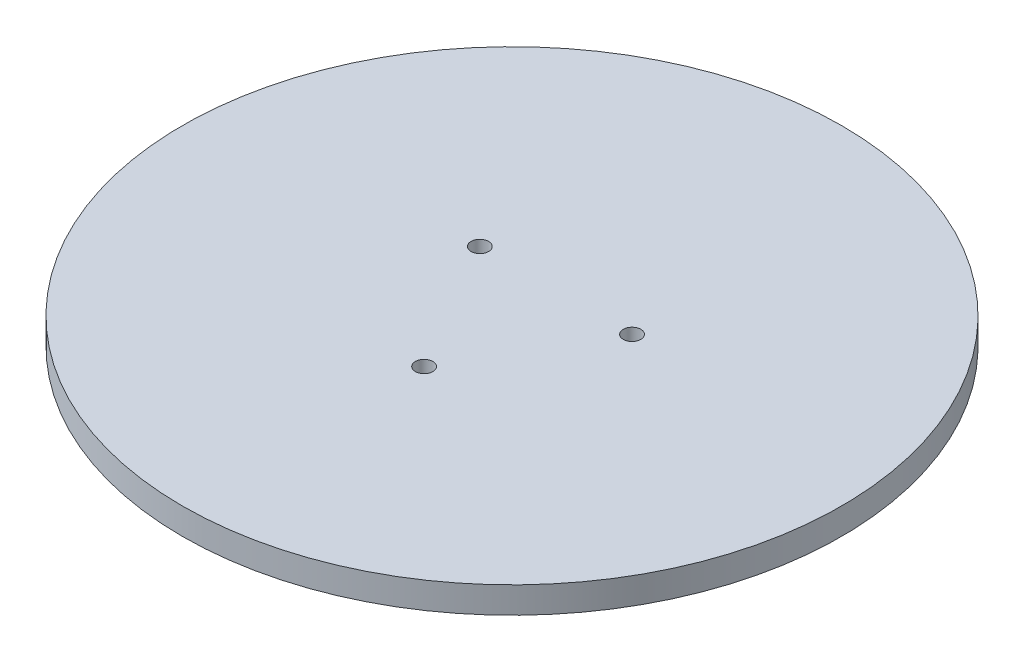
ISO-10303-21;
HEADER;
FILE_DESCRIPTION(('STEP AP214'),'2;1');
FILE_NAME('part.step','',(''),(''),'','','');
FILE_SCHEMA(('AUTOMOTIVE_DESIGN { 1 0 10303 214 1 1 1 1 }'));
ENDSEC;
DATA;
#1=APPLICATION_CONTEXT('core data for automotive mechanical design processes');
#2=APPLICATION_PROTOCOL_DEFINITION('international standard','automotive_design',2000,#1);
#3=PRODUCT_CONTEXT('',#1,'mechanical');
#4=PRODUCT('Part','Part','',(#3));
#5=PRODUCT_RELATED_PRODUCT_CATEGORY('part','',(#4));
#6=PRODUCT_DEFINITION_FORMATION('','',#4);
#7=PRODUCT_DEFINITION_CONTEXT('part definition',#1,'design');
#8=PRODUCT_DEFINITION('design','',#6,#7);
#9=PRODUCT_DEFINITION_SHAPE('','',#8);
#10=(LENGTH_UNIT() NAMED_UNIT(*) SI_UNIT(.MILLI.,.METRE.));
#11=(NAMED_UNIT(*) PLANE_ANGLE_UNIT() SI_UNIT($,.RADIAN.));
#12=(NAMED_UNIT(*) SI_UNIT($,.STERADIAN.) SOLID_ANGLE_UNIT());
#13=UNCERTAINTY_MEASURE_WITH_UNIT(LENGTH_MEASURE(1.E-05),#10,'distance_accuracy_value','');
#14=(GEOMETRIC_REPRESENTATION_CONTEXT(3) GLOBAL_UNCERTAINTY_ASSIGNED_CONTEXT((#13)) GLOBAL_UNIT_ASSIGNED_CONTEXT((#10,
#11,#12)) REPRESENTATION_CONTEXT('',''));
#15=CARTESIAN_POINT('',(0.,0.,0.));
#16=DIRECTION('',(0.,0.,1.));
#17=DIRECTION('',(1.,0.,0.));
#18=AXIS2_PLACEMENT_3D('',#15,#16,#17);
#19=CARTESIAN_POINT('',(0.,6.,0.));
#20=DIRECTION('',(0.,-1.,0.));
#21=DIRECTION('',(0.,0.,-1.));
#22=AXIS2_PLACEMENT_3D('',#19,#20,#21);
#23=CYLINDRICAL_SURFACE('',#22,75.);
#24=CARTESIAN_POINT('',(0.,6.,0.));
#25=DIRECTION('',(0.,1.,0.));
#26=DIRECTION('',(0.,0.,1.));
#27=AXIS2_PLACEMENT_3D('',#24,#25,#26);
#28=CIRCLE('',#27,75.);
#29=CARTESIAN_POINT('',(0.,6.,75.));
#30=VERTEX_POINT('',#29);
#31=EDGE_CURVE('E10',#30,#30,#28,.T.);
#32=ORIENTED_EDGE('',*,*,#31,.F.);
#33=EDGE_LOOP('',(#32));
#34=FACE_BOUND('',#33,.T.);
#35=CARTESIAN_POINT('',(0.,0.,0.));
#36=DIRECTION('',(0.,1.,0.));
#37=DIRECTION('',(0.,0.,1.));
#38=AXIS2_PLACEMENT_3D('',#35,#36,#37);
#39=CIRCLE('',#38,75.);
#40=CARTESIAN_POINT('',(0.,0.,75.));
#41=VERTEX_POINT('',#40);
#42=EDGE_CURVE('E35',#41,#41,#39,.T.);
#43=ORIENTED_EDGE('',*,*,#42,.T.);
#44=EDGE_LOOP('',(#43));
#45=FACE_BOUND('',#44,.T.);
#46=ADVANCED_FACE('F32',(#34,#45),#23,.T.);
#47=CARTESIAN_POINT('',(0.,6.,0.));
#48=DIRECTION('',(0.,1.,0.));
#49=DIRECTION('',(0.,0.,1.));
#50=AXIS2_PLACEMENT_3D('',#47,#48,#49);
#51=PLANE('',#50);
#52=CARTESIAN_POINT('',(0.,6.,20.));
#53=DIRECTION('',(0.,1.,0.));
#54=DIRECTION('',(0.,0.,1.));
#55=AXIS2_PLACEMENT_3D('',#52,#53,#54);
#56=CIRCLE('',#55,2.);
#57=CARTESIAN_POINT('',(0.,6.,18.));
#58=VERTEX_POINT('',#57);
#59=EDGE_CURVE('E56',#58,#58,#56,.F.);
#60=ORIENTED_EDGE('',*,*,#59,.T.);
#61=EDGE_LOOP('',(#60));
#62=FACE_BOUND('',#61,.T.);
#63=CARTESIAN_POINT('',(17.3205080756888,6.,-10.));
#64=DIRECTION('',(0.,1.,0.));
#65=DIRECTION('',(0.,0.,1.));
#66=AXIS2_PLACEMENT_3D('',#63,#64,#65);
#67=CIRCLE('',#66,2.00000000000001);
#68=CARTESIAN_POINT('',(17.3205080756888,6.,-12.));
#69=VERTEX_POINT('',#68);
#70=EDGE_CURVE('E50',#69,#69,#67,.F.);
#71=ORIENTED_EDGE('',*,*,#70,.T.);
#72=EDGE_LOOP('',(#71));
#73=FACE_BOUND('',#72,.T.);
#74=CARTESIAN_POINT('',(-17.3205080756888,6.,-10.));
#75=DIRECTION('',(0.,1.,0.));
#76=DIRECTION('',(0.,0.,1.));
#77=AXIS2_PLACEMENT_3D('',#74,#75,#76);
#78=CIRCLE('',#77,2.00000000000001);
#79=CARTESIAN_POINT('',(-17.3205080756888,6.,-12.));
#80=VERTEX_POINT('',#79);
#81=EDGE_CURVE('E44',#80,#80,#78,.F.);
#82=ORIENTED_EDGE('',*,*,#81,.T.);
#83=EDGE_LOOP('',(#82));
#84=FACE_BOUND('',#83,.T.);
#85=ORIENTED_EDGE('',*,*,#31,.T.);
#86=EDGE_LOOP('',(#85));
#87=FACE_BOUND('',#86,.T.);
#88=ADVANCED_FACE('F68',(#62,#73,#84,#87),#51,.T.);
#89=CARTESIAN_POINT('',(0.,0.,0.));
#90=DIRECTION('',(0.,1.,0.));
#91=DIRECTION('',(0.,0.,1.));
#92=AXIS2_PLACEMENT_3D('',#89,#90,#91);
#93=PLANE('',#92);
#94=CARTESIAN_POINT('',(0.,0.,20.));
#95=DIRECTION('',(0.,-1.,0.));
#96=DIRECTION('',(0.,0.,-1.));
#97=AXIS2_PLACEMENT_3D('',#94,#95,#96);
#98=CIRCLE('',#97,2.);
#99=CARTESIAN_POINT('',(0.,0.,18.));
#100=VERTEX_POINT('',#99);
#101=EDGE_CURVE('E42',#100,#100,#98,.T.);
#102=ORIENTED_EDGE('',*,*,#101,.F.);
#103=EDGE_LOOP('',(#102));
#104=FACE_BOUND('',#103,.T.);
#105=CARTESIAN_POINT('',(17.3205080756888,0.,-10.));
#106=DIRECTION('',(0.,-1.,0.));
#107=DIRECTION('',(0.,0.,-1.));
#108=AXIS2_PLACEMENT_3D('',#105,#106,#107);
#109=CIRCLE('',#108,2.00000000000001);
#110=CARTESIAN_POINT('',(17.3205080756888,0.,-12.));
#111=VERTEX_POINT('',#110);
#112=EDGE_CURVE('E53',#111,#111,#109,.T.);
#113=ORIENTED_EDGE('',*,*,#112,.F.);
#114=EDGE_LOOP('',(#113));
#115=FACE_BOUND('',#114,.T.);
#116=CARTESIAN_POINT('',(-17.3205080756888,0.,-10.));
#117=DIRECTION('',(0.,-1.,0.));
#118=DIRECTION('',(0.,0.,-1.));
#119=AXIS2_PLACEMENT_3D('',#116,#117,#118);
#120=CIRCLE('',#119,2.00000000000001);
#121=CARTESIAN_POINT('',(-17.3205080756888,0.,-12.));
#122=VERTEX_POINT('',#121);
#123=EDGE_CURVE('E47',#122,#122,#120,.T.);
#124=ORIENTED_EDGE('',*,*,#123,.F.);
#125=EDGE_LOOP('',(#124));
#126=FACE_BOUND('',#125,.T.);
#127=ORIENTED_EDGE('',*,*,#42,.F.);
#128=EDGE_LOOP('',(#127));
#129=FACE_BOUND('',#128,.T.);
#130=ADVANCED_FACE('F64',(#104,#115,#126,#129),#93,.F.);
#131=CARTESIAN_POINT('',(-17.3205080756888,6.001,-10.));
#132=DIRECTION('',(0.,-1.,0.));
#133=DIRECTION('',(0.,0.,-1.));
#134=AXIS2_PLACEMENT_3D('',#131,#132,#133);
#135=CYLINDRICAL_SURFACE('',#134,2.00000000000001);
#136=CARTESIAN_POINT('',(-17.3205080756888,6.,-12.));
#137=CARTESIAN_POINT('',(-17.3205080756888,5.9375,-12.));
#138=CARTESIAN_POINT('',(-17.3205080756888,5.875,-12.));
#139=CARTESIAN_POINT('',(-17.3205080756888,5.75,-12.));
#140=CARTESIAN_POINT('',(-17.3205080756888,5.6875,-12.));
#141=CARTESIAN_POINT('',(-17.3205080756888,5.5625,-12.));
#142=CARTESIAN_POINT('',(-17.3205080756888,5.5,-12.));
#143=CARTESIAN_POINT('',(-17.3205080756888,5.375,-12.));
#144=CARTESIAN_POINT('',(-17.3205080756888,5.3125,-12.));
#145=CARTESIAN_POINT('',(-17.3205080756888,5.1875,-12.));
#146=CARTESIAN_POINT('',(-17.3205080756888,5.125,-12.));
#147=CARTESIAN_POINT('',(-17.3205080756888,5.,-12.));
#148=CARTESIAN_POINT('',(-17.3205080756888,4.9375,-12.));
#149=CARTESIAN_POINT('',(-17.3205080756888,4.8125,-12.));
#150=CARTESIAN_POINT('',(-17.3205080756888,4.75,-12.));
#151=CARTESIAN_POINT('',(-17.3205080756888,4.625,-12.));
#152=CARTESIAN_POINT('',(-17.3205080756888,4.5625,-12.));
#153=CARTESIAN_POINT('',(-17.3205080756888,4.4375,-12.));
#154=CARTESIAN_POINT('',(-17.3205080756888,4.375,-12.));
#155=CARTESIAN_POINT('',(-17.3205080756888,4.25,-12.));
#156=CARTESIAN_POINT('',(-17.3205080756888,4.1875,-12.));
#157=CARTESIAN_POINT('',(-17.3205080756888,4.0625,-12.));
#158=CARTESIAN_POINT('',(-17.3205080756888,4.,-12.));
#159=CARTESIAN_POINT('',(-17.3205080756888,3.875,-12.));
#160=CARTESIAN_POINT('',(-17.3205080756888,3.8125,-12.));
#161=CARTESIAN_POINT('',(-17.3205080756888,3.6875,-12.));
#162=CARTESIAN_POINT('',(-17.3205080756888,3.625,-12.));
#163=CARTESIAN_POINT('',(-17.3205080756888,3.5,-12.));
#164=CARTESIAN_POINT('',(-17.3205080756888,3.4375,-12.));
#165=CARTESIAN_POINT('',(-17.3205080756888,3.3125,-12.));
#166=CARTESIAN_POINT('',(-17.3205080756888,3.25,-12.));
#167=CARTESIAN_POINT('',(-17.3205080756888,3.125,-12.));
#168=CARTESIAN_POINT('',(-17.3205080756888,3.0625,-12.));
#169=CARTESIAN_POINT('',(-17.3205080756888,2.9375,-12.));
#170=CARTESIAN_POINT('',(-17.3205080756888,2.875,-12.));
#171=CARTESIAN_POINT('',(-17.3205080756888,2.75,-12.));
#172=CARTESIAN_POINT('',(-17.3205080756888,2.6875,-12.));
#173=CARTESIAN_POINT('',(-17.3205080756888,2.5625,-12.));
#174=CARTESIAN_POINT('',(-17.3205080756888,2.5,-12.));
#175=CARTESIAN_POINT('',(-17.3205080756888,2.375,-12.));
#176=CARTESIAN_POINT('',(-17.3205080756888,2.3125,-12.));
#177=CARTESIAN_POINT('',(-17.3205080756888,2.1875,-12.));
#178=CARTESIAN_POINT('',(-17.3205080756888,2.125,-12.));
#179=CARTESIAN_POINT('',(-17.3205080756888,2.,-12.));
#180=CARTESIAN_POINT('',(-17.3205080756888,1.9375,-12.));
#181=CARTESIAN_POINT('',(-17.3205080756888,1.8125,-12.));
#182=CARTESIAN_POINT('',(-17.3205080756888,1.75,-12.));
#183=CARTESIAN_POINT('',(-17.3205080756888,1.625,-12.));
#184=CARTESIAN_POINT('',(-17.3205080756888,1.5625,-12.));
#185=CARTESIAN_POINT('',(-17.3205080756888,1.4375,-12.));
#186=CARTESIAN_POINT('',(-17.3205080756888,1.375,-12.));
#187=CARTESIAN_POINT('',(-17.3205080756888,1.25,-12.));
#188=CARTESIAN_POINT('',(-17.3205080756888,1.1875,-12.));
#189=CARTESIAN_POINT('',(-17.3205080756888,1.0625,-12.));
#190=CARTESIAN_POINT('',(-17.3205080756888,1.,-12.));
#191=CARTESIAN_POINT('',(-17.3205080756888,0.875,-12.));
#192=CARTESIAN_POINT('',(-17.3205080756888,0.8125,-12.));
#193=CARTESIAN_POINT('',(-17.3205080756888,0.6875,-12.));
#194=CARTESIAN_POINT('',(-17.3205080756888,0.625,-12.));
#195=CARTESIAN_POINT('',(-17.3205080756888,0.5,-12.));
#196=CARTESIAN_POINT('',(-17.3205080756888,0.4375,-12.));
#197=CARTESIAN_POINT('',(-17.3205080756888,0.3125,-12.));
#198=CARTESIAN_POINT('',(-17.3205080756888,0.25,-12.));
#199=CARTESIAN_POINT('',(-17.3205080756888,0.125,-12.));
#200=CARTESIAN_POINT('',(-17.3205080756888,0.0625000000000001,-12.));
#201=CARTESIAN_POINT('',(-17.3205080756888,0.,-12.));
#202=B_SPLINE_CURVE_WITH_KNOTS('',3,(#136,#137,#138,#139,#140,#141,#142,#143,#144,#145,#146,
#147,#148,#149,#150,#151,#152,#153,#154,#155,#156,#157,#158,#159,#160,#161,#162,#163,#164,#165,
#166,#167,#168,#169,#170,#171,#172,#173,#174,#175,#176,#177,#178,#179,#180,#181,#182,#183,#184,
#185,#186,#187,#188,#189,#190,#191,#192,#193,#194,#195,#196,#197,#198,#199,#200,#201),
.UNSPECIFIED.,.F.,.F.,(4,2,2,2,2,2,2,2,2,2,2,2,2,2,2,2,2,2,2,2,2,2,2,2,2,2,2,2,2,2,2,2,4),(0.,
0.187499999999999,0.374999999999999,0.5625,0.75,0.937499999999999,1.125,1.3125,1.5,1.6875,1.875,
2.0625,2.25,2.4375,2.625,2.8125,3.,3.1875,3.375,3.5625,3.75,3.9375,4.125,4.3125,4.5,4.6875,
4.875,5.0625,5.25,5.4375,5.625,5.8125,6.),.UNSPECIFIED.);
#203=EDGE_CURVE('BSEAM67',#80,#122,#202,.T.);
#204=ORIENTED_EDGE('',*,*,#81,.F.);
#205=ORIENTED_EDGE('',*,*,#123,.T.);
#206=ORIENTED_EDGE('',*,*,#203,.T.);
#207=ORIENTED_EDGE('',*,*,#203,.F.);
#208=EDGE_LOOP('',(#204,#206,#205,#207));
#209=FACE_BOUND('',#208,.T.);
#210=ADVANCED_FACE('F67',(#209),#135,.F.);
#211=CARTESIAN_POINT('',(17.3205080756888,6.001,-10.));
#212=DIRECTION('',(0.,-1.,0.));
#213=DIRECTION('',(0.,0.,-1.));
#214=AXIS2_PLACEMENT_3D('',#211,#212,#213);
#215=CYLINDRICAL_SURFACE('',#214,2.00000000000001);
#216=CARTESIAN_POINT('',(17.3205080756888,6.,-12.));
#217=CARTESIAN_POINT('',(17.3205080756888,5.9375,-12.));
#218=CARTESIAN_POINT('',(17.3205080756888,5.875,-12.));
#219=CARTESIAN_POINT('',(17.3205080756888,5.75,-12.));
#220=CARTESIAN_POINT('',(17.3205080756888,5.6875,-12.));
#221=CARTESIAN_POINT('',(17.3205080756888,5.5625,-12.));
#222=CARTESIAN_POINT('',(17.3205080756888,5.5,-12.));
#223=CARTESIAN_POINT('',(17.3205080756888,5.375,-12.));
#224=CARTESIAN_POINT('',(17.3205080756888,5.3125,-12.));
#225=CARTESIAN_POINT('',(17.3205080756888,5.1875,-12.));
#226=CARTESIAN_POINT('',(17.3205080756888,5.125,-12.));
#227=CARTESIAN_POINT('',(17.3205080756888,5.,-12.));
#228=CARTESIAN_POINT('',(17.3205080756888,4.9375,-12.));
#229=CARTESIAN_POINT('',(17.3205080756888,4.8125,-12.));
#230=CARTESIAN_POINT('',(17.3205080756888,4.75,-12.));
#231=CARTESIAN_POINT('',(17.3205080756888,4.625,-12.));
#232=CARTESIAN_POINT('',(17.3205080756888,4.5625,-12.));
#233=CARTESIAN_POINT('',(17.3205080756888,4.4375,-12.));
#234=CARTESIAN_POINT('',(17.3205080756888,4.375,-12.));
#235=CARTESIAN_POINT('',(17.3205080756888,4.25,-12.));
#236=CARTESIAN_POINT('',(17.3205080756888,4.1875,-12.));
#237=CARTESIAN_POINT('',(17.3205080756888,4.0625,-12.));
#238=CARTESIAN_POINT('',(17.3205080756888,4.,-12.));
#239=CARTESIAN_POINT('',(17.3205080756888,3.875,-12.));
#240=CARTESIAN_POINT('',(17.3205080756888,3.8125,-12.));
#241=CARTESIAN_POINT('',(17.3205080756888,3.6875,-12.));
#242=CARTESIAN_POINT('',(17.3205080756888,3.625,-12.));
#243=CARTESIAN_POINT('',(17.3205080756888,3.5,-12.));
#244=CARTESIAN_POINT('',(17.3205080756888,3.4375,-12.));
#245=CARTESIAN_POINT('',(17.3205080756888,3.3125,-12.));
#246=CARTESIAN_POINT('',(17.3205080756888,3.25,-12.));
#247=CARTESIAN_POINT('',(17.3205080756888,3.125,-12.));
#248=CARTESIAN_POINT('',(17.3205080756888,3.0625,-12.));
#249=CARTESIAN_POINT('',(17.3205080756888,2.9375,-12.));
#250=CARTESIAN_POINT('',(17.3205080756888,2.875,-12.));
#251=CARTESIAN_POINT('',(17.3205080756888,2.75,-12.));
#252=CARTESIAN_POINT('',(17.3205080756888,2.6875,-12.));
#253=CARTESIAN_POINT('',(17.3205080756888,2.5625,-12.));
#254=CARTESIAN_POINT('',(17.3205080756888,2.5,-12.));
#255=CARTESIAN_POINT('',(17.3205080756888,2.375,-12.));
#256=CARTESIAN_POINT('',(17.3205080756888,2.3125,-12.));
#257=CARTESIAN_POINT('',(17.3205080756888,2.1875,-12.));
#258=CARTESIAN_POINT('',(17.3205080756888,2.125,-12.));
#259=CARTESIAN_POINT('',(17.3205080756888,2.,-12.));
#260=CARTESIAN_POINT('',(17.3205080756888,1.9375,-12.));
#261=CARTESIAN_POINT('',(17.3205080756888,1.8125,-12.));
#262=CARTESIAN_POINT('',(17.3205080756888,1.75,-12.));
#263=CARTESIAN_POINT('',(17.3205080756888,1.625,-12.));
#264=CARTESIAN_POINT('',(17.3205080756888,1.5625,-12.));
#265=CARTESIAN_POINT('',(17.3205080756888,1.4375,-12.));
#266=CARTESIAN_POINT('',(17.3205080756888,1.375,-12.));
#267=CARTESIAN_POINT('',(17.3205080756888,1.25,-12.));
#268=CARTESIAN_POINT('',(17.3205080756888,1.1875,-12.));
#269=CARTESIAN_POINT('',(17.3205080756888,1.0625,-12.));
#270=CARTESIAN_POINT('',(17.3205080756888,1.,-12.));
#271=CARTESIAN_POINT('',(17.3205080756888,0.875,-12.));
#272=CARTESIAN_POINT('',(17.3205080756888,0.8125,-12.));
#273=CARTESIAN_POINT('',(17.3205080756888,0.6875,-12.));
#274=CARTESIAN_POINT('',(17.3205080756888,0.625,-12.));
#275=CARTESIAN_POINT('',(17.3205080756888,0.5,-12.));
#276=CARTESIAN_POINT('',(17.3205080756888,0.4375,-12.));
#277=CARTESIAN_POINT('',(17.3205080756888,0.3125,-12.));
#278=CARTESIAN_POINT('',(17.3205080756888,0.25,-12.));
#279=CARTESIAN_POINT('',(17.3205080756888,0.125,-12.));
#280=CARTESIAN_POINT('',(17.3205080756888,0.0625000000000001,-12.));
#281=CARTESIAN_POINT('',(17.3205080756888,0.,-12.));
#282=B_SPLINE_CURVE_WITH_KNOTS('',3,(#216,#217,#218,#219,#220,#221,#222,#223,#224,#225,#226,
#227,#228,#229,#230,#231,#232,#233,#234,#235,#236,#237,#238,#239,#240,#241,#242,#243,#244,#245,
#246,#247,#248,#249,#250,#251,#252,#253,#254,#255,#256,#257,#258,#259,#260,#261,#262,#263,#264,
#265,#266,#267,#268,#269,#270,#271,#272,#273,#274,#275,#276,#277,#278,#279,#280,#281),
.UNSPECIFIED.,.F.,.F.,(4,2,2,2,2,2,2,2,2,2,2,2,2,2,2,2,2,2,2,2,2,2,2,2,2,2,2,2,2,2,2,2,4),(0.,
0.187499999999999,0.374999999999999,0.5625,0.75,0.937499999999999,1.125,1.3125,1.5,1.6875,1.875,
2.0625,2.25,2.4375,2.625,2.8125,3.,3.1875,3.375,3.5625,3.75,3.9375,4.125,4.3125,4.5,4.6875,
4.875,5.0625,5.25,5.4375,5.625,5.8125,6.),.UNSPECIFIED.);
#283=EDGE_CURVE('BSEAM88',#69,#111,#282,.T.);
#284=ORIENTED_EDGE('',*,*,#70,.F.);
#285=ORIENTED_EDGE('',*,*,#112,.T.);
#286=ORIENTED_EDGE('',*,*,#283,.T.);
#287=ORIENTED_EDGE('',*,*,#283,.F.);
#288=EDGE_LOOP('',(#284,#286,#285,#287));
#289=FACE_BOUND('',#288,.T.);
#290=ADVANCED_FACE('F88',(#289),#215,.F.);
#291=CARTESIAN_POINT('',(0.,6.001,20.));
#292=DIRECTION('',(0.,-1.,0.));
#293=DIRECTION('',(0.,0.,-1.));
#294=AXIS2_PLACEMENT_3D('',#291,#292,#293);
#295=CYLINDRICAL_SURFACE('',#294,2.);
#296=CARTESIAN_POINT('',(0.,6.,18.));
#297=CARTESIAN_POINT('',(0.,5.9375,18.));
#298=CARTESIAN_POINT('',(0.,5.875,18.));
#299=CARTESIAN_POINT('',(0.,5.75,18.));
#300=CARTESIAN_POINT('',(0.,5.6875,18.));
#301=CARTESIAN_POINT('',(0.,5.5625,18.));
#302=CARTESIAN_POINT('',(0.,5.5,18.));
#303=CARTESIAN_POINT('',(0.,5.375,18.));
#304=CARTESIAN_POINT('',(0.,5.3125,18.));
#305=CARTESIAN_POINT('',(0.,5.1875,18.));
#306=CARTESIAN_POINT('',(0.,5.125,18.));
#307=CARTESIAN_POINT('',(0.,5.,18.));
#308=CARTESIAN_POINT('',(0.,4.9375,18.));
#309=CARTESIAN_POINT('',(0.,4.8125,18.));
#310=CARTESIAN_POINT('',(0.,4.75,18.));
#311=CARTESIAN_POINT('',(0.,4.625,18.));
#312=CARTESIAN_POINT('',(0.,4.5625,18.));
#313=CARTESIAN_POINT('',(0.,4.4375,18.));
#314=CARTESIAN_POINT('',(0.,4.375,18.));
#315=CARTESIAN_POINT('',(0.,4.25,18.));
#316=CARTESIAN_POINT('',(0.,4.1875,18.));
#317=CARTESIAN_POINT('',(0.,4.0625,18.));
#318=CARTESIAN_POINT('',(0.,4.,18.));
#319=CARTESIAN_POINT('',(0.,3.875,18.));
#320=CARTESIAN_POINT('',(0.,3.8125,18.));
#321=CARTESIAN_POINT('',(0.,3.6875,18.));
#322=CARTESIAN_POINT('',(0.,3.625,18.));
#323=CARTESIAN_POINT('',(0.,3.5,18.));
#324=CARTESIAN_POINT('',(0.,3.4375,18.));
#325=CARTESIAN_POINT('',(0.,3.3125,18.));
#326=CARTESIAN_POINT('',(0.,3.25,18.));
#327=CARTESIAN_POINT('',(0.,3.125,18.));
#328=CARTESIAN_POINT('',(0.,3.0625,18.));
#329=CARTESIAN_POINT('',(0.,2.9375,18.));
#330=CARTESIAN_POINT('',(0.,2.875,18.));
#331=CARTESIAN_POINT('',(0.,2.75,18.));
#332=CARTESIAN_POINT('',(0.,2.6875,18.));
#333=CARTESIAN_POINT('',(0.,2.5625,18.));
#334=CARTESIAN_POINT('',(0.,2.5,18.));
#335=CARTESIAN_POINT('',(0.,2.375,18.));
#336=CARTESIAN_POINT('',(0.,2.3125,18.));
#337=CARTESIAN_POINT('',(0.,2.1875,18.));
#338=CARTESIAN_POINT('',(0.,2.125,18.));
#339=CARTESIAN_POINT('',(0.,2.,18.));
#340=CARTESIAN_POINT('',(0.,1.9375,18.));
#341=CARTESIAN_POINT('',(0.,1.8125,18.));
#342=CARTESIAN_POINT('',(0.,1.75,18.));
#343=CARTESIAN_POINT('',(0.,1.625,18.));
#344=CARTESIAN_POINT('',(0.,1.5625,18.));
#345=CARTESIAN_POINT('',(0.,1.4375,18.));
#346=CARTESIAN_POINT('',(0.,1.375,18.));
#347=CARTESIAN_POINT('',(0.,1.25,18.));
#348=CARTESIAN_POINT('',(0.,1.1875,18.));
#349=CARTESIAN_POINT('',(0.,1.0625,18.));
#350=CARTESIAN_POINT('',(0.,1.,18.));
#351=CARTESIAN_POINT('',(0.,0.875,18.));
#352=CARTESIAN_POINT('',(0.,0.8125,18.));
#353=CARTESIAN_POINT('',(0.,0.6875,18.));
#354=CARTESIAN_POINT('',(0.,0.625,18.));
#355=CARTESIAN_POINT('',(0.,0.5,18.));
#356=CARTESIAN_POINT('',(0.,0.4375,18.));
#357=CARTESIAN_POINT('',(0.,0.3125,18.));
#358=CARTESIAN_POINT('',(0.,0.25,18.));
#359=CARTESIAN_POINT('',(0.,0.125,18.));
#360=CARTESIAN_POINT('',(0.,0.0625000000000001,18.));
#361=CARTESIAN_POINT('',(0.,0.,18.));
#362=B_SPLINE_CURVE_WITH_KNOTS('',3,(#296,#297,#298,#299,#300,#301,#302,#303,#304,#305,#306,
#307,#308,#309,#310,#311,#312,#313,#314,#315,#316,#317,#318,#319,#320,#321,#322,#323,#324,#325,
#326,#327,#328,#329,#330,#331,#332,#333,#334,#335,#336,#337,#338,#339,#340,#341,#342,#343,#344,
#345,#346,#347,#348,#349,#350,#351,#352,#353,#354,#355,#356,#357,#358,#359,#360,#361),
.UNSPECIFIED.,.F.,.F.,(4,2,2,2,2,2,2,2,2,2,2,2,2,2,2,2,2,2,2,2,2,2,2,2,2,2,2,2,2,2,2,2,4),(0.,
0.187499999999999,0.374999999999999,0.5625,0.75,0.937499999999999,1.125,1.3125,1.5,1.6875,1.875,
2.0625,2.25,2.4375,2.625,2.8125,3.,3.1875,3.375,3.5625,3.75,3.9375,4.125,4.3125,4.5,4.6875,
4.875,5.0625,5.25,5.4375,5.625,5.8125,6.),.UNSPECIFIED.);
#363=EDGE_CURVE('BSEAM62',#58,#100,#362,.T.);
#364=ORIENTED_EDGE('',*,*,#59,.F.);
#365=ORIENTED_EDGE('',*,*,#101,.T.);
#366=ORIENTED_EDGE('',*,*,#363,.T.);
#367=ORIENTED_EDGE('',*,*,#363,.F.);
#368=EDGE_LOOP('',(#364,#366,#365,#367));
#369=FACE_BOUND('',#368,.T.);
#370=ADVANCED_FACE('F62',(#369),#295,.F.);
#371=CLOSED_SHELL('',(#46,#88,#130,#210,#290,#370));
#372=MANIFOLD_SOLID_BREP('B2',#371);
#373=ADVANCED_BREP_SHAPE_REPRESENTATION('',(#18,#372),#14);
#374=SHAPE_DEFINITION_REPRESENTATION(#9,#373);
ENDSEC;
END-ISO-10303-21;
